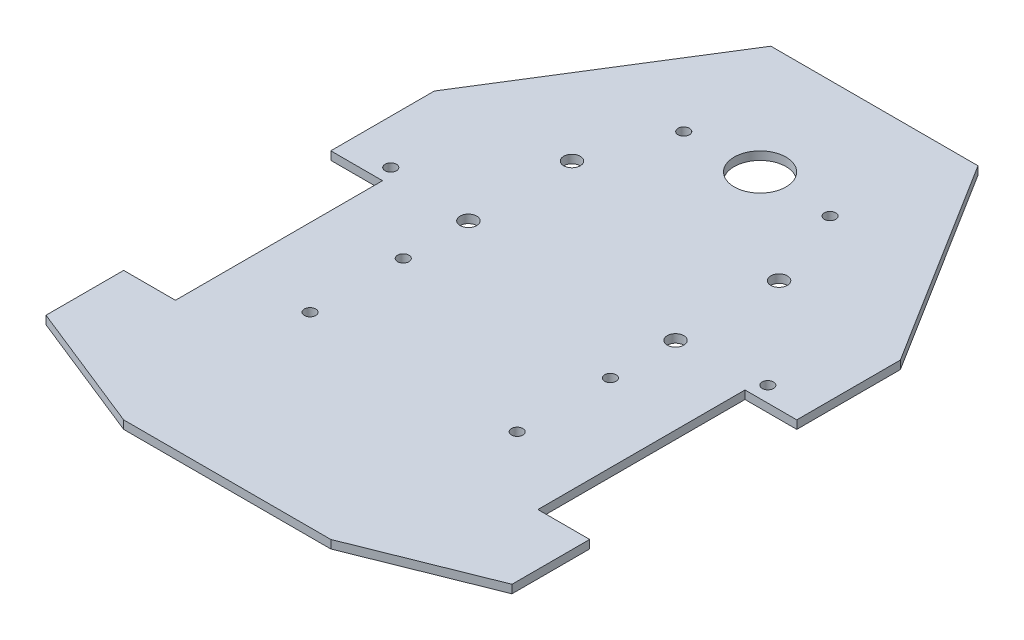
from build123d import *

# Parameters (mm, degrees)
SKETCH1_R           = 5
BOSS_EXTRUDE1_DEPTH = 1.6
SKETCH2_R           = 1.1
CUT_EXTRUDE1_DEPTH  = 80.073130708
CUT_EXTRUDE2_REACH  = 81.073
SKETCH3_R           = 1.6
CUT_EXTRUDE3_REACH  = 81.073
SKETCH5_R           = 1.1


with BuildPart() as part:
    # Sketch1 → Boss-Extrude1 (new body)
    with BuildSketch(Plane(origin=(0, 0, 0), x_dir=(1, 0, 0), z_dir=(0, 1, 0))):
        Polygon((-20, 65), (20, 65), (45, 25), (45, 5), (35, 5), (35, -35), (45, -35), (45, -50), (20, -60), (-20, -60), (-45, -50), (-45, -35), (-35, -35), (-35, 5), (-45, 5), (-45, 25), align=None)
        with Locations(Location((0, 42.914947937, 0), (0, 0, 270))):
            Circle(SKETCH1_R, mode=Mode.SUBTRACT)
    extrude(amount=BOSS_EXTRUDE1_DEPTH)

    # Sketch2 → Cut-Extrude1 (cut, through all)
    with BuildSketch(Plane(origin=(0, 1.6, 0), x_dir=(1, 0, 0), z_dir=(0, 1, 0))):
        with Locations(Location((-20, -6, 0), (0, 0, 270))):
            Circle(SKETCH2_R)
        with Locations(Location((-20, -24, 0), (0, 0, 90))):
            Circle(SKETCH2_R)
        with Locations(Location((20, -24, 0), (0, 0, 270))):
            Circle(SKETCH2_R)
        with Locations(Location((20, -6, 0), (0, 0, 90))):
            Circle(SKETCH2_R)
    extrude(amount=-CUT_EXTRUDE1_DEPTH, mode=Mode.SUBTRACT)

    # Sketch3 → Cut-Extrude2 (cut, up to next)
    with BuildSketch(Plane(origin=(0, 1.6, 0), x_dir=(1, 0, 0), z_dir=(0, 1, 0)), mode=Mode.PRIVATE) as cut_extrude2_sk1:
        with Locations(Location((-20, 26.581871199, 0), (0, 0, 270))):
            Circle(SKETCH3_R)
    cut_extrude2_tool1 = extrude(cut_extrude2_sk1.sketch, amount=-CUT_EXTRUDE2_REACH, mode=Mode.PRIVATE) & part.part
    # Sketch3 → Cut-Extrude2 (cut, up to next)
    with BuildSketch(Plane(origin=(0, 1.6, 0), x_dir=(1, 0, 0), z_dir=(0, 1, 0)), mode=Mode.PRIVATE) as cut_extrude2_sk2:
        with Locations(Location((20, 26.581871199, 0), (0, 0, 270))):
            Circle(SKETCH3_R)
    cut_extrude2_tool2 = extrude(cut_extrude2_sk2.sketch, amount=-CUT_EXTRUDE2_REACH, mode=Mode.PRIVATE) & part.part
    # Sketch3 → Cut-Extrude2 (cut, up to next)
    with BuildSketch(Plane(origin=(0, 1.6, 0), x_dir=(1, 0, 0), z_dir=(0, 1, 0)), mode=Mode.PRIVATE) as cut_extrude2_sk3:
        with Locations(Location((20, 6.581871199, 0), (0, 0, 270))):
            Circle(SKETCH3_R)
    cut_extrude2_tool3 = extrude(cut_extrude2_sk3.sketch, amount=-CUT_EXTRUDE2_REACH, mode=Mode.PRIVATE) & part.part
    # Sketch3 → Cut-Extrude2 (cut, up to next)
    with BuildSketch(Plane(origin=(0, 1.6, 0), x_dir=(1, 0, 0), z_dir=(0, 1, 0)), mode=Mode.PRIVATE) as cut_extrude2_sk4:
        with Locations(Location((-20, 6.581871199, 0), (0, 0, 270))):
            Circle(SKETCH3_R)
    cut_extrude2_tool4 = extrude(cut_extrude2_sk4.sketch, amount=-CUT_EXTRUDE2_REACH, mode=Mode.PRIVATE) & part.part
    add(cut_extrude2_tool1.solids().sort_by_distance((-20, 1.6, -26.581871))[0], mode=Mode.SUBTRACT)
    add(cut_extrude2_tool2.solids().sort_by_distance((20, 1.6, -26.581871))[0], mode=Mode.SUBTRACT)
    add(cut_extrude2_tool3.solids().sort_by_distance((20, 1.6, -6.581871))[0], mode=Mode.SUBTRACT)
    add(cut_extrude2_tool4.solids().sort_by_distance((-20, 1.6, -6.581871))[0], mode=Mode.SUBTRACT)

    # Sketch5 → Cut-Extrude3 (cut, up to next)
    with BuildSketch(Plane(origin=(0, 1.6, 0), x_dir=(1, 0, 0), z_dir=(0, 1, 0)), mode=Mode.PRIVATE) as cut_extrude3_sk1:
        with Locations(Location((-36.412283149, 8, 0), (0, 0, 270))):
            Circle(SKETCH5_R)
    cut_extrude3_tool1 = extrude(cut_extrude3_sk1.sketch, amount=-CUT_EXTRUDE3_REACH, mode=Mode.PRIVATE) & part.part
    # Sketch5 → Cut-Extrude3 (cut, up to next)
    with BuildSketch(Plane(origin=(0, 1.6, 0), x_dir=(1, 0, 0), z_dir=(0, 1, 0)), mode=Mode.PRIVATE) as cut_extrude3_sk2:
        with Locations(Location((36.412283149, 8, 0), (0, 0, 270))):
            Circle(SKETCH5_R)
    cut_extrude3_tool2 = extrude(cut_extrude3_sk2.sketch, amount=-CUT_EXTRUDE3_REACH, mode=Mode.PRIVATE) & part.part
    # Sketch5 → Cut-Extrude3 (cut, up to next)
    with BuildSketch(Plane(origin=(0, 1.6, 0), x_dir=(1, 0, 0), z_dir=(0, 1, 0)), mode=Mode.PRIVATE) as cut_extrude3_sk3:
        with Locations(Location((-14.134917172, 42.301953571, 0), (0, 0, 270))):
            Circle(SKETCH5_R)
    cut_extrude3_tool3 = extrude(cut_extrude3_sk3.sketch, amount=-CUT_EXTRUDE3_REACH, mode=Mode.PRIVATE) & part.part
    # Sketch5 → Cut-Extrude3 (cut, up to next)
    with BuildSketch(Plane(origin=(0, 1.6, 0), x_dir=(1, 0, 0), z_dir=(0, 1, 0)), mode=Mode.PRIVATE) as cut_extrude3_sk4:
        with Locations(Location((14.134917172, 42.301953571, 0), (0, 0, 270))):
            Circle(SKETCH5_R)
    cut_extrude3_tool4 = extrude(cut_extrude3_sk4.sketch, amount=-CUT_EXTRUDE3_REACH, mode=Mode.PRIVATE) & part.part
    add(cut_extrude3_tool1.solids().sort_by_distance((-36.412283, 1.6, -8))[0], mode=Mode.SUBTRACT)
    add(cut_extrude3_tool2.solids().sort_by_distance((36.412283, 1.6, -8))[0], mode=Mode.SUBTRACT)
    add(cut_extrude3_tool3.solids().sort_by_distance((-14.134917, 1.6, -42.301954))[0], mode=Mode.SUBTRACT)
    add(cut_extrude3_tool4.solids().sort_by_distance((14.134917, 1.6, -42.301954))[0], mode=Mode.SUBTRACT)


solid = part.part
